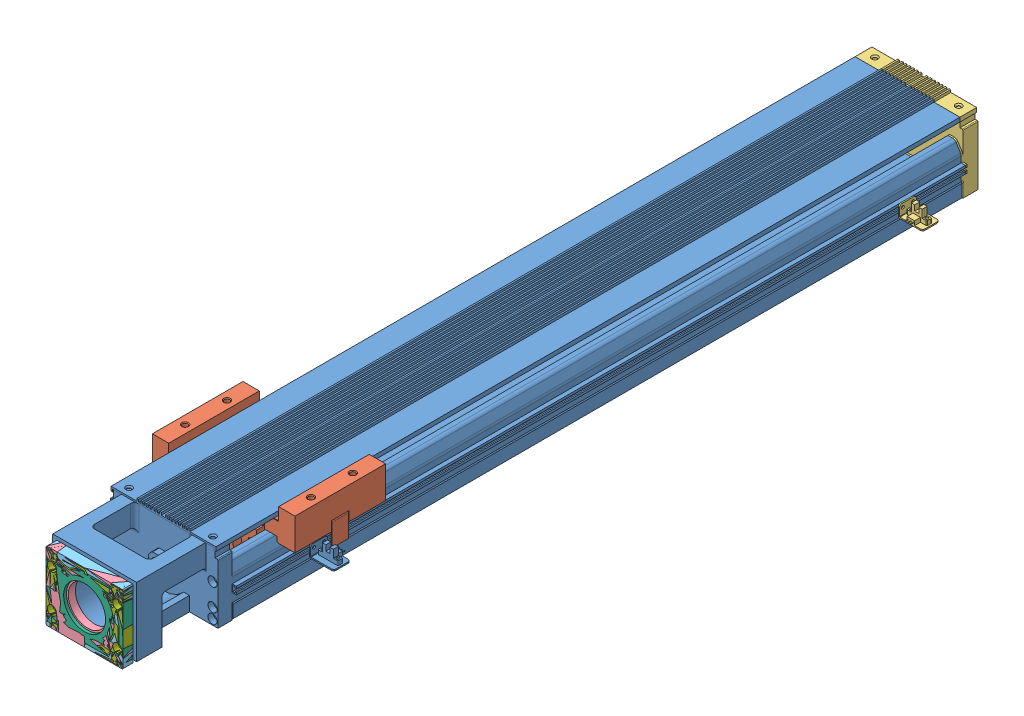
SolidWorks assembly FF130-B-0.SLDASM, configuration 880 (file format 9000). Lengths in mm.
Overall size (183 95 1001).
7 component instances, 7 part files, 19 mates.
Components (placement in the parent):
- FF130-B-3-1: FF130-B-3.sldprt [880] at origin size (167 88 969)
- FF130-B-1-1: FF130-B-1.sldprt [默认] at (0 0 -10.6827)
- FF130-B-2-1: FF130-B-2.sldprt [默认] at (0 0 -191)
- 电机法兰（59系列步进电机）-1: 电机法兰（59系列步进电机）.SLDPRT [默认] at (-59.8258 11.369 399) x (-1 0 0) z (0 1 0)
- 电机法兰（86系列步进电机）-1: 电机法兰（86系列步进电机）.SLDPRT [默认] at (-59.8258 11.369 399) x (-1 0 0) z (0 1 0)
- 电机法兰（三菱200W-400W）(安川100W-200W-400W)-1: 电机法兰（三菱200W-400W）(安川100W-200W-400W).SLDPRT [默认] at (-59.8258 11.369 399) x (-1 0 0) z (0 1 0)
- 电机法兰（松下750W）-1: 电机法兰（松下750W）.SLDPRT [默认] at (-59.8258 11.369 399) x (-1 0 0) z (0 1 0)
Mates (geometry in assembly coordinates):
- 重合4: coincident aligned: plane of FF130-B-3-1 through (5.1742 -7.647 -394.6) normal (1 0 0); plane of FF130-B-2-1 through (5.1742 -7.647 -585.6) normal (1 0 0)
- 重合5: coincident aligned: plane of FF130-B-3-1 through (-3.8418 -26.631 -394.6) normal (0 -1 0); plane of FF130-B-2-1 through (-3.8418 -26.631 -585.6) normal (0 -1 0)
- 重合6: coincident anti-aligned: plane of FF130-B-3-1 through (-118.8258 18.935 -570) normal (0 0 -1); plane of FF130-B-2-1 through (-203.3939 945.1116 -570) normal (0 0 1)
- 距离1: distance = 20 mm aligned: plane of FF130-B-1-1 through (25.1742 26.609 135.0573) normal (1 0 0); plane of FF130-B-3-1 through (5.1742 -7.647 -394.6) normal (1 0 0)
- 距离2: distance = 92 mm anti-aligned: plane of FF130-B-1-1 through (25.5642 65.369 247.3773) normal (0 1 0); plane of FF130-B-3-1 through (-3.8418 -26.631 -394.6) normal (0 -1 0)
- LimitDistance1: limit distance = 20.2827 mm anti-aligned: plane of FF130-B-1-1 through (-91.5465 -10.471 263.7173) normal (0 0 1); plane of FF130-B-3-1 through (-32.7858 34.353 284) normal (0 0 -1)
- LimitDistance2: limit distance = 700.7173 mm anti-aligned: plane of FF130-B-1-1 through (-109.2258 -10.551 128.7173) normal (0 0 -1); plane of FF130-B-2-1 through (-126.3858 -12.991 -572) normal (0 0 1)
- 重合8: coincident anti-aligned: plane of FF130-B-3-1 through (-7.8258 58.009 399) normal (0 0 1); plane of 电机法兰（59系列步进电机）-1 through (-11.9858 54.009 399) normal (0 0 -1)
- 同心1: concentric aligned: cylinder of FF130-B-3-1 through (-98.797 33.869 382) axis (0 0 1) radius 2.5; cylinder of 电机法兰（59系列步进电机）-1 through (-98.797 33.869 404.5) axis (0 0 1) radius 5.5
- 同心2: concentric aligned: cylinder of FF130-B-3-1 through (-20.8547 33.869 382) axis (0 0 1) radius 2.5; cylinder of 电机法兰（59系列步进电机）-1 through (-20.8547 33.869 404.5) axis (0 0 1) radius 5.5
- 重合9: coincident anti-aligned: plane of FF130-B-3-1 through (-7.8258 58.009 399) normal (0 0 1); plane of 电机法兰（松下750W）-1 through (-11.9858 52.969 399) normal (0 0 -1)
- 同心3: concentric aligned: cylinder of FF130-B-3-1 through (-20.8547 33.869 382) axis (0 0 1) radius 2.5; cylinder of 电机法兰（松下750W）-1 through (-20.8547 33.869 404.5) axis (0 0 1) radius 5.5
- 同心4: concentric aligned: cylinder of FF130-B-3-1 through (-98.797 33.869 382) axis (0 0 1) radius 2.5; cylinder of 电机法兰（松下750W）-1 through (-98.797 33.869 404.5) axis (0 0 1) radius 5.5
- 重合10: coincident anti-aligned: plane of FF130-B-3-1 through (-7.8258 58.009 399) normal (0 0 1); plane of 电机法兰（86系列步进电机）-1 through (-11.9858 54.009 399) normal (0 0 -1)
- 同心5: concentric aligned: cylinder of FF130-B-3-1 through (-20.8547 33.869 382) axis (0 0 1) radius 2.5; cylinder of 电机法兰（86系列步进电机）-1 through (-20.8547 33.869 404.5) axis (0 0 1) radius 5.5
- 同心6: concentric aligned: cylinder of FF130-B-3-1 through (-98.797 33.869 382) axis (0 0 1) radius 2.5; cylinder of 电机法兰（86系列步进电机）-1 through (-98.797 33.869 404.5) axis (0 0 1) radius 5.5
- 重合11: coincident anti-aligned: plane of FF130-B-3-1 through (-7.8258 58.009 399) normal (0 0 1); plane of 电机法兰（三菱200W-400W）(安川100W-200W-400W)-1 through (-11.9858 49.329 399) normal (0 0 -1)
- 同心7: concentric aligned: cylinder of FF130-B-3-1 through (-20.8547 33.869 382) axis (0 0 1) radius 2.5; cylinder of 电机法兰（三菱200W-400W）(安川100W-200W-400W)-1 through (-20.8547 33.869 404.5) axis (0 0 1) radius 5.5
- 同心8: concentric aligned: cylinder of FF130-B-3-1 through (-98.797 33.869 382) axis (0 0 1) radius 2.5; cylinder of 电机法兰（三菱200W-400W）(安川100W-200W-400W)-1 through (-98.797 33.869 404.5) axis (0 0 1) radius 5.5
